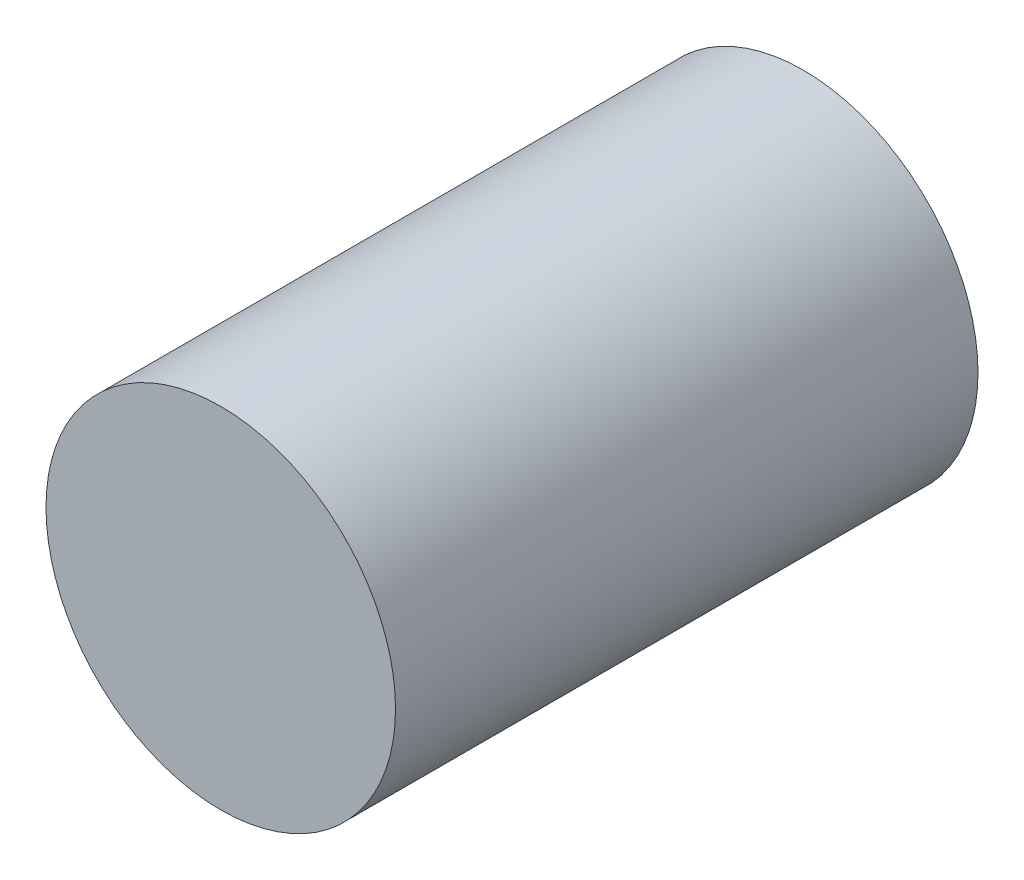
ISO-10303-21;
HEADER;
FILE_DESCRIPTION(('STEP AP214'),'2;1');
FILE_NAME('part.step','',(''),(''),'','','');
FILE_SCHEMA(('AUTOMOTIVE_DESIGN { 1 0 10303 214 1 1 1 1 }'));
ENDSEC;
DATA;
#1=APPLICATION_CONTEXT('core data for automotive mechanical design processes');
#2=APPLICATION_PROTOCOL_DEFINITION('international standard','automotive_design',2000,#1);
#3=PRODUCT_CONTEXT('',#1,'mechanical');
#4=PRODUCT('Part','Part','',(#3));
#5=PRODUCT_RELATED_PRODUCT_CATEGORY('part','',(#4));
#6=PRODUCT_DEFINITION_FORMATION('','',#4);
#7=PRODUCT_DEFINITION_CONTEXT('part definition',#1,'design');
#8=PRODUCT_DEFINITION('design','',#6,#7);
#9=PRODUCT_DEFINITION_SHAPE('','',#8);
#10=(LENGTH_UNIT() NAMED_UNIT(*) SI_UNIT(.MILLI.,.METRE.));
#11=(NAMED_UNIT(*) PLANE_ANGLE_UNIT() SI_UNIT($,.RADIAN.));
#12=(NAMED_UNIT(*) SI_UNIT($,.STERADIAN.) SOLID_ANGLE_UNIT());
#13=UNCERTAINTY_MEASURE_WITH_UNIT(LENGTH_MEASURE(1.E-05),#10,'distance_accuracy_value','');
#14=(GEOMETRIC_REPRESENTATION_CONTEXT(3) GLOBAL_UNCERTAINTY_ASSIGNED_CONTEXT((#13)) GLOBAL_UNIT_ASSIGNED_CONTEXT((#10,
#11,#12)) REPRESENTATION_CONTEXT('',''));
#15=CARTESIAN_POINT('',(0.,0.,0.));
#16=DIRECTION('',(0.,0.,1.));
#17=DIRECTION('',(1.,0.,0.));
#18=AXIS2_PLACEMENT_3D('',#15,#16,#17);
#19=CARTESIAN_POINT('',(0.,0.,30.));
#20=DIRECTION('',(0.,0.,-1.));
#21=DIRECTION('',(-1.,0.,0.));
#22=AXIS2_PLACEMENT_3D('',#19,#20,#21);
#23=CYLINDRICAL_SURFACE('',#22,9.);
#24=CARTESIAN_POINT('',(0.,0.,30.));
#25=DIRECTION('',(0.,0.,1.));
#26=DIRECTION('',(1.,0.,0.));
#27=AXIS2_PLACEMENT_3D('',#24,#25,#26);
#28=CIRCLE('',#27,9.);
#29=CARTESIAN_POINT('',(9.,0.,30.));
#30=VERTEX_POINT('',#29);
#31=EDGE_CURVE('E12',#30,#30,#28,.T.);
#32=ORIENTED_EDGE('',*,*,#31,.F.);
#33=EDGE_LOOP('',(#32));
#34=FACE_BOUND('',#33,.T.);
#35=CARTESIAN_POINT('',(0.,0.,0.));
#36=DIRECTION('',(0.,0.,1.));
#37=DIRECTION('',(1.,0.,0.));
#38=AXIS2_PLACEMENT_3D('',#35,#36,#37);
#39=CIRCLE('',#38,9.);
#40=CARTESIAN_POINT('',(9.,0.,0.));
#41=VERTEX_POINT('',#40);
#42=EDGE_CURVE('E45',#41,#41,#39,.T.);
#43=ORIENTED_EDGE('',*,*,#42,.T.);
#44=EDGE_LOOP('',(#43));
#45=FACE_BOUND('',#44,.T.);
#46=ADVANCED_FACE('F42',(#34,#45),#23,.T.);
#47=CARTESIAN_POINT('',(0.,0.,30.));
#48=DIRECTION('',(0.,0.,1.));
#49=DIRECTION('',(1.,0.,0.));
#50=AXIS2_PLACEMENT_3D('',#47,#48,#49);
#51=PLANE('',#50);
#52=ORIENTED_EDGE('',*,*,#31,.T.);
#53=EDGE_LOOP('',(#52));
#54=FACE_BOUND('',#53,.T.);
#55=ADVANCED_FACE('F57',(#54),#51,.T.);
#56=CARTESIAN_POINT('',(0.,0.,0.));
#57=DIRECTION('',(0.,0.,1.));
#58=DIRECTION('',(1.,0.,0.));
#59=AXIS2_PLACEMENT_3D('',#56,#57,#58);
#60=PLANE('',#59);
#61=ORIENTED_EDGE('',*,*,#42,.F.);
#62=EDGE_LOOP('',(#61));
#63=FACE_BOUND('',#62,.T.);
#64=ADVANCED_FACE('F55',(#63),#60,.F.);
#65=CLOSED_SHELL('',(#46,#55,#64));
#66=MANIFOLD_SOLID_BREP('B2',#65);
#67=ADVANCED_BREP_SHAPE_REPRESENTATION('',(#18,#66),#14);
#68=SHAPE_DEFINITION_REPRESENTATION(#9,#67);
ENDSEC;
END-ISO-10303-21;
